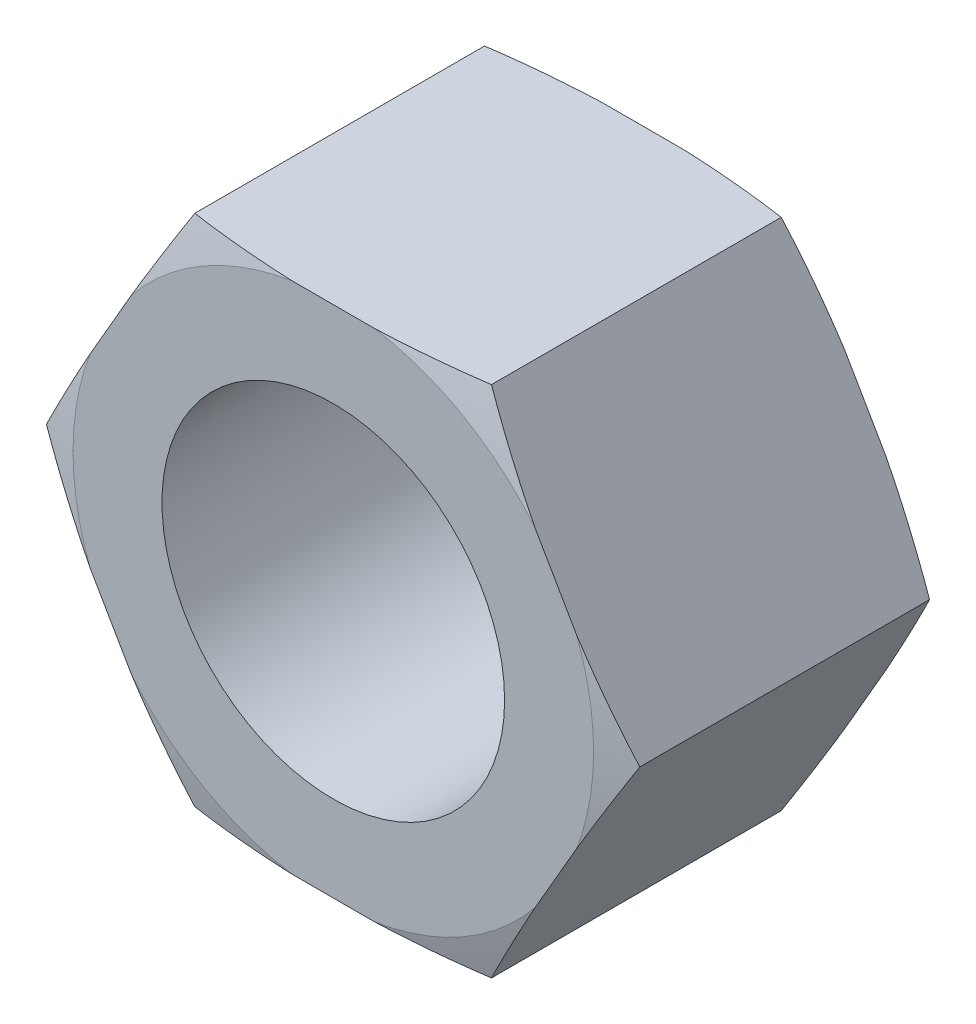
ISO-10303-21;
HEADER;
FILE_DESCRIPTION(('STEP AP214'),'2;1');
FILE_NAME('part.step','',(''),(''),'','','');
FILE_SCHEMA(('AUTOMOTIVE_DESIGN { 1 0 10303 214 1 1 1 1 }'));
ENDSEC;
DATA;
#1=APPLICATION_CONTEXT('core data for automotive mechanical design processes');
#2=APPLICATION_PROTOCOL_DEFINITION('international standard','automotive_design',2000,#1);
#3=PRODUCT_CONTEXT('',#1,'mechanical');
#4=PRODUCT('Part','Part','',(#3));
#5=PRODUCT_RELATED_PRODUCT_CATEGORY('part','',(#4));
#6=PRODUCT_DEFINITION_FORMATION('','',#4);
#7=PRODUCT_DEFINITION_CONTEXT('part definition',#1,'design');
#8=PRODUCT_DEFINITION('design','',#6,#7);
#9=PRODUCT_DEFINITION_SHAPE('','',#8);
#10=(LENGTH_UNIT() NAMED_UNIT(*) SI_UNIT(.MILLI.,.METRE.));
#11=(NAMED_UNIT(*) PLANE_ANGLE_UNIT() SI_UNIT($,.RADIAN.));
#12=(NAMED_UNIT(*) SI_UNIT($,.STERADIAN.) SOLID_ANGLE_UNIT());
#13=UNCERTAINTY_MEASURE_WITH_UNIT(LENGTH_MEASURE(1.E-05),#10,'distance_accuracy_value','');
#14=(GEOMETRIC_REPRESENTATION_CONTEXT(3) GLOBAL_UNCERTAINTY_ASSIGNED_CONTEXT((#13)) GLOBAL_UNIT_ASSIGNED_CONTEXT((#10,
#11,#12)) REPRESENTATION_CONTEXT('',''));
#15=CARTESIAN_POINT('',(0.,0.,0.));
#16=DIRECTION('',(0.,0.,1.));
#17=DIRECTION('',(1.,0.,0.));
#18=AXIS2_PLACEMENT_3D('',#15,#16,#17);
#19=CARTESIAN_POINT('',(6.92820323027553,12.,23.4500000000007));
#20=DIRECTION('',(0.866025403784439,0.5,0.));
#21=DIRECTION('',(-0.5,0.866025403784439,0.));
#22=AXIS2_PLACEMENT_3D('',#19,#20,#21);
#23=PLANE('',#22);
#24=DIRECTION('',(0.,0.,-1.));
#25=VECTOR('',#24,1.);
#26=CARTESIAN_POINT('',(13.856406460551,0.,23.4500000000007));
#27=LINE('',#26,#25);
#28=CARTESIAN_POINT('',(13.856406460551,0.,22.9916485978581));
#29=VERTEX_POINT('',#28);
#30=CARTESIAN_POINT('',(13.856406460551,0.,9.4583514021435));
#31=VERTEX_POINT('',#30);
#32=EDGE_CURVE('E190',#29,#31,#27,.T.);
#33=ORIENTED_EDGE('',*,*,#32,.T.);
#34=CARTESIAN_POINT('',(10.3923048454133,6.,57.5000000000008));
#35=DIRECTION('',(0.866025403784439,0.5,0.));
#36=DIRECTION('',(-0.5,0.866025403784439,0.));
#37=AXIS2_PLACEMENT_3D('',#34,#35,#36);
#38=CIRCLE('',#37,48.5386443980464);
#39=CARTESIAN_POINT('',(11.3605506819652,4.3229490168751,9.00000000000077));
#40=VERTEX_POINT('',#39);
#41=EDGE_CURVE('E233',#31,#40,#38,.T.);
#42=ORIENTED_EDGE('',*,*,#41,.T.);
#43=DIRECTION('',(0.5,-0.866025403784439,0.));
#44=VECTOR('',#43,1.);
#45=CARTESIAN_POINT('',(6.92820323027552,12.,9.00000000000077));
#46=LINE('',#45,#44);
#47=CARTESIAN_POINT('',(9.42405900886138,7.67705098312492,9.00000000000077));
#48=VERTEX_POINT('',#47);
#49=EDGE_CURVE('E209',#48,#40,#46,.T.);
#50=ORIENTED_EDGE('',*,*,#49,.F.);
#51=CARTESIAN_POINT('',(6.92820323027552,12.,9.4583514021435));
#52=VERTEX_POINT('',#51);
#53=EDGE_CURVE('E235',#48,#52,#38,.T.);
#54=ORIENTED_EDGE('',*,*,#53,.T.);
#55=DIRECTION('',(0.,0.,-1.));
#56=VECTOR('',#55,1.);
#57=CARTESIAN_POINT('',(6.92820323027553,12.,23.4500000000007));
#58=LINE('',#57,#56);
#59=CARTESIAN_POINT('',(6.92820323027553,12.,22.9916485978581));
#60=VERTEX_POINT('',#59);
#61=EDGE_CURVE('E150',#60,#52,#58,.T.);
#62=ORIENTED_EDGE('',*,*,#61,.F.);
#63=CARTESIAN_POINT('',(10.3923048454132,6.,-25.0499999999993));
#64=DIRECTION('',(0.866025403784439,0.5,0.));
#65=DIRECTION('',(-0.5,0.866025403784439,0.));
#66=AXIS2_PLACEMENT_3D('',#63,#64,#65);
#67=CIRCLE('',#66,48.5386443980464);
#68=CARTESIAN_POINT('',(9.42405900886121,7.67705098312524,23.4500000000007));
#69=VERTEX_POINT('',#68);
#70=EDGE_CURVE('E283',#60,#69,#67,.T.);
#71=ORIENTED_EDGE('',*,*,#70,.T.);
#72=DIRECTION('',(0.5,-0.866025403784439,0.));
#73=VECTOR('',#72,1.);
#74=CARTESIAN_POINT('',(6.92820323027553,12.,23.4500000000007));
#75=LINE('',#74,#73);
#76=CARTESIAN_POINT('',(11.3605506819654,4.32294901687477,23.4500000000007));
#77=VERTEX_POINT('',#76);
#78=EDGE_CURVE('E177',#69,#77,#75,.T.);
#79=ORIENTED_EDGE('',*,*,#78,.T.);
#80=EDGE_CURVE('E284',#77,#29,#67,.T.);
#81=ORIENTED_EDGE('',*,*,#80,.T.);
#82=EDGE_LOOP('',(#33,#42,#50,#54,#62,#71,#79,#81));
#83=FACE_BOUND('',#82,.T.);
#84=ADVANCED_FACE('F16',(#83),#23,.T.);
#85=CARTESIAN_POINT('',(-6.92820323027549,12.,23.4500000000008));
#86=DIRECTION('',(0.,1.,0.));
#87=DIRECTION('',(0.,0.,1.));
#88=AXIS2_PLACEMENT_3D('',#85,#86,#87);
#89=PLANE('',#88);
#90=ORIENTED_EDGE('',*,*,#61,.T.);
#91=CARTESIAN_POINT('',(0.,12.,57.5000000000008));
#92=DIRECTION('',(0.,1.,0.));
#93=DIRECTION('',(0.,0.,1.));
#94=AXIS2_PLACEMENT_3D('',#91,#92,#93);
#95=CIRCLE('',#94,48.5386443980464);
#96=CARTESIAN_POINT('',(1.93649167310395,12.,9.00000000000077));
#97=VERTEX_POINT('',#96);
#98=EDGE_CURVE('E234',#52,#97,#95,.T.);
#99=ORIENTED_EDGE('',*,*,#98,.T.);
#100=DIRECTION('',(1.,0.,0.));
#101=VECTOR('',#100,1.);
#102=CARTESIAN_POINT('',(-6.9282032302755,12.,9.00000000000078));
#103=LINE('',#102,#101);
#104=CARTESIAN_POINT('',(-1.93649167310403,12.,9.00000000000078));
#105=VERTEX_POINT('',#104);
#106=EDGE_CURVE('E169',#105,#97,#103,.T.);
#107=ORIENTED_EDGE('',*,*,#106,.F.);
#108=CARTESIAN_POINT('',(-6.9282032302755,12.,9.4583514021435));
#109=VERTEX_POINT('',#108);
#110=EDGE_CURVE('E239',#105,#109,#95,.T.);
#111=ORIENTED_EDGE('',*,*,#110,.T.);
#112=DIRECTION('',(0.,0.,-1.));
#113=VECTOR('',#112,1.);
#114=CARTESIAN_POINT('',(-6.92820323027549,12.,23.4500000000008));
#115=LINE('',#114,#113);
#116=CARTESIAN_POINT('',(-6.92820323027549,12.,22.9916485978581));
#117=VERTEX_POINT('',#116);
#118=EDGE_CURVE('E180',#117,#109,#115,.T.);
#119=ORIENTED_EDGE('',*,*,#118,.F.);
#120=CARTESIAN_POINT('',(0.,12.,-25.0499999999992));
#121=DIRECTION('',(0.,1.,0.));
#122=DIRECTION('',(0.,0.,1.));
#123=AXIS2_PLACEMENT_3D('',#120,#121,#122);
#124=CIRCLE('',#123,48.5386443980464);
#125=CARTESIAN_POINT('',(-1.93649167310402,12.,23.4500000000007));
#126=VERTEX_POINT('',#125);
#127=EDGE_CURVE('E278',#117,#126,#124,.T.);
#128=ORIENTED_EDGE('',*,*,#127,.T.);
#129=DIRECTION('',(1.,0.,0.));
#130=VECTOR('',#129,1.);
#131=CARTESIAN_POINT('',(-6.92820323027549,12.,23.4500000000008));
#132=LINE('',#131,#130);
#133=CARTESIAN_POINT('',(1.93649167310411,12.,23.4500000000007));
#134=VERTEX_POINT('',#133);
#135=EDGE_CURVE('E192',#126,#134,#132,.T.);
#136=ORIENTED_EDGE('',*,*,#135,.T.);
#137=EDGE_CURVE('E281',#134,#60,#124,.T.);
#138=ORIENTED_EDGE('',*,*,#137,.T.);
#139=EDGE_LOOP('',(#90,#99,#107,#111,#119,#128,#136,#138));
#140=FACE_BOUND('',#139,.T.);
#141=ADVANCED_FACE('F300',(#140),#89,.T.);
#142=CARTESIAN_POINT('',(-13.856406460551,0.,23.4500000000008));
#143=DIRECTION('',(-0.866025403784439,0.5,0.));
#144=DIRECTION('',(-0.5,-0.866025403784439,0.));
#145=AXIS2_PLACEMENT_3D('',#142,#143,#144);
#146=PLANE('',#145);
#147=ORIENTED_EDGE('',*,*,#118,.T.);
#148=CARTESIAN_POINT('',(-10.3923048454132,6.,57.5000000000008));
#149=DIRECTION('',(-0.866025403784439,0.5,0.));
#150=DIRECTION('',(-0.5,-0.866025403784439,0.));
#151=AXIS2_PLACEMENT_3D('',#148,#149,#150);
#152=CIRCLE('',#151,48.5386443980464);
#153=CARTESIAN_POINT('',(-9.42405900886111,7.67705098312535,9.00000000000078));
#154=VERTEX_POINT('',#153);
#155=EDGE_CURVE('E241',#109,#154,#152,.T.);
#156=ORIENTED_EDGE('',*,*,#155,.T.);
#157=DIRECTION('',(0.5,0.866025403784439,0.));
#158=VECTOR('',#157,1.);
#159=CARTESIAN_POINT('',(-13.856406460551,0.,9.00000000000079));
#160=LINE('',#159,#158);
#161=CARTESIAN_POINT('',(-11.3605506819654,4.32294901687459,9.00000000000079));
#162=VERTEX_POINT('',#161);
#163=EDGE_CURVE('E166',#162,#154,#160,.T.);
#164=ORIENTED_EDGE('',*,*,#163,.F.);
#165=CARTESIAN_POINT('',(-13.856406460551,0.,9.4583514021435));
#166=VERTEX_POINT('',#165);
#167=EDGE_CURVE('E144',#162,#166,#152,.T.);
#168=ORIENTED_EDGE('',*,*,#167,.T.);
#169=DIRECTION('',(0.,0.,-1.));
#170=VECTOR('',#169,1.);
#171=CARTESIAN_POINT('',(-13.856406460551,0.,23.4500000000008));
#172=LINE('',#171,#170);
#173=CARTESIAN_POINT('',(-13.856406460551,0.,22.9916485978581));
#174=VERTEX_POINT('',#173);
#175=EDGE_CURVE('E160',#174,#166,#172,.T.);
#176=ORIENTED_EDGE('',*,*,#175,.F.);
#177=CARTESIAN_POINT('',(-10.3923048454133,6.,-25.0499999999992));
#178=DIRECTION('',(-0.866025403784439,0.5,0.));
#179=DIRECTION('',(-0.5,-0.866025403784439,0.));
#180=AXIS2_PLACEMENT_3D('',#177,#178,#179);
#181=CIRCLE('',#180,48.5386443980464);
#182=CARTESIAN_POINT('',(-11.3605506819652,4.32294901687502,23.4500000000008));
#183=VERTEX_POINT('',#182);
#184=EDGE_CURVE('E290',#174,#183,#181,.T.);
#185=ORIENTED_EDGE('',*,*,#184,.T.);
#186=DIRECTION('',(0.5,0.866025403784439,0.));
#187=VECTOR('',#186,1.);
#188=CARTESIAN_POINT('',(-13.856406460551,0.,23.4500000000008));
#189=LINE('',#188,#187);
#190=CARTESIAN_POINT('',(-9.42405900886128,7.67705098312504,23.4500000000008));
#191=VERTEX_POINT('',#190);
#192=EDGE_CURVE('E198',#183,#191,#189,.T.);
#193=ORIENTED_EDGE('',*,*,#192,.T.);
#194=EDGE_CURVE('E292',#191,#117,#181,.T.);
#195=ORIENTED_EDGE('',*,*,#194,.T.);
#196=EDGE_LOOP('',(#147,#156,#164,#168,#176,#185,#193,#195));
#197=FACE_BOUND('',#196,.T.);
#198=ADVANCED_FACE('F294',(#197),#146,.T.);
#199=CARTESIAN_POINT('',(-6.92820323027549,-12.,23.4500000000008));
#200=DIRECTION('',(-0.866025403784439,-0.5,0.));
#201=DIRECTION('',(0.5,-0.866025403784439,0.));
#202=AXIS2_PLACEMENT_3D('',#199,#200,#201);
#203=PLANE('',#202);
#204=ORIENTED_EDGE('',*,*,#175,.T.);
#205=CARTESIAN_POINT('',(-10.3923048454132,-6.,57.5000000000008));
#206=DIRECTION('',(-0.866025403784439,-0.5,0.));
#207=DIRECTION('',(0.5,-0.866025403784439,0.));
#208=AXIS2_PLACEMENT_3D('',#205,#206,#207);
#209=CIRCLE('',#208,48.5386443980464);
#210=CARTESIAN_POINT('',(-11.3605506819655,-4.32294901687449,9.00000000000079));
#211=VERTEX_POINT('',#210);
#212=EDGE_CURVE('E142',#166,#211,#209,.T.);
#213=ORIENTED_EDGE('',*,*,#212,.T.);
#214=DIRECTION('',(-0.5,0.866025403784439,0.));
#215=VECTOR('',#214,1.);
#216=CARTESIAN_POINT('',(-6.92820323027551,-12.,9.00000000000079));
#217=LINE('',#216,#215);
#218=CARTESIAN_POINT('',(-9.42405900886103,-7.67705098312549,9.00000000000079));
#219=VERTEX_POINT('',#218);
#220=EDGE_CURVE('E157',#219,#211,#217,.T.);
#221=ORIENTED_EDGE('',*,*,#220,.F.);
#222=CARTESIAN_POINT('',(-6.9282032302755,-12.,9.4583514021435));
#223=VERTEX_POINT('',#222);
#224=EDGE_CURVE('E162',#219,#223,#209,.T.);
#225=ORIENTED_EDGE('',*,*,#224,.T.);
#226=DIRECTION('',(0.,0.,-1.));
#227=VECTOR('',#226,1.);
#228=CARTESIAN_POINT('',(-6.92820323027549,-12.,23.4500000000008));
#229=LINE('',#228,#227);
#230=CARTESIAN_POINT('',(-6.92820323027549,-12.,22.9916485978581));
#231=VERTEX_POINT('',#230);
#232=EDGE_CURVE('E184',#231,#223,#229,.T.);
#233=ORIENTED_EDGE('',*,*,#232,.F.);
#234=CARTESIAN_POINT('',(-10.3923048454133,-6.,-25.0499999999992));
#235=DIRECTION('',(-0.866025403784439,-0.5,0.));
#236=DIRECTION('',(0.5,-0.866025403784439,0.));
#237=AXIS2_PLACEMENT_3D('',#234,#235,#236);
#238=CIRCLE('',#237,48.5386443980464);
#239=CARTESIAN_POINT('',(-9.42405900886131,-7.67705098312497,23.4500000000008));
#240=VERTEX_POINT('',#239);
#241=EDGE_CURVE('E256',#231,#240,#238,.T.);
#242=ORIENTED_EDGE('',*,*,#241,.T.);
#243=DIRECTION('',(-0.5,0.866025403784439,0.));
#244=VECTOR('',#243,1.);
#245=CARTESIAN_POINT('',(-6.92820323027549,-12.,23.4500000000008));
#246=LINE('',#245,#244);
#247=CARTESIAN_POINT('',(-11.3605506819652,-4.32294901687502,23.4500000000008));
#248=VERTEX_POINT('',#247);
#249=EDGE_CURVE('E205',#240,#248,#246,.T.);
#250=ORIENTED_EDGE('',*,*,#249,.T.);
#251=EDGE_CURVE('E247',#248,#174,#238,.T.);
#252=ORIENTED_EDGE('',*,*,#251,.T.);
#253=EDGE_LOOP('',(#204,#213,#221,#225,#233,#242,#250,#252));
#254=FACE_BOUND('',#253,.T.);
#255=ADVANCED_FACE('F155',(#254),#203,.T.);
#256=CARTESIAN_POINT('',(6.92820323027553,-12.,23.4500000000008));
#257=DIRECTION('',(0.,-1.,0.));
#258=DIRECTION('',(1.,0.,0.));
#259=AXIS2_PLACEMENT_3D('',#256,#257,#258);
#260=PLANE('',#259);
#261=ORIENTED_EDGE('',*,*,#232,.T.);
#262=CARTESIAN_POINT('',(0.,-12.,57.5000000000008));
#263=DIRECTION('',(0.,-1.,0.));
#264=DIRECTION('',(1.,0.,0.));
#265=AXIS2_PLACEMENT_3D('',#262,#263,#264);
#266=CIRCLE('',#265,48.5386443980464);
#267=CARTESIAN_POINT('',(-1.93649167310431,-12.,9.00000000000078));
#268=VERTEX_POINT('',#267);
#269=EDGE_CURVE('E231',#223,#268,#266,.T.);
#270=ORIENTED_EDGE('',*,*,#269,.T.);
#271=DIRECTION('',(-1.,0.,0.));
#272=VECTOR('',#271,1.);
#273=CARTESIAN_POINT('',(6.92820323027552,-12.,9.00000000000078));
#274=LINE('',#273,#272);
#275=CARTESIAN_POINT('',(1.93649167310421,-12.,9.00000000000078));
#276=VERTEX_POINT('',#275);
#277=EDGE_CURVE('E167',#276,#268,#274,.T.);
#278=ORIENTED_EDGE('',*,*,#277,.F.);
#279=CARTESIAN_POINT('',(6.92820323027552,-12.,9.4583514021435));
#280=VERTEX_POINT('',#279);
#281=EDGE_CURVE('E228',#276,#280,#266,.T.);
#282=ORIENTED_EDGE('',*,*,#281,.T.);
#283=DIRECTION('',(0.,0.,-1.));
#284=VECTOR('',#283,1.);
#285=CARTESIAN_POINT('',(6.92820323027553,-12.,23.4500000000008));
#286=LINE('',#285,#284);
#287=CARTESIAN_POINT('',(6.92820323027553,-12.,22.9916485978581));
#288=VERTEX_POINT('',#287);
#289=EDGE_CURVE('E187',#288,#280,#286,.T.);
#290=ORIENTED_EDGE('',*,*,#289,.F.);
#291=CARTESIAN_POINT('',(0.,-12.,-25.0499999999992));
#292=DIRECTION('',(0.,-1.,0.));
#293=DIRECTION('',(1.,0.,0.));
#294=AXIS2_PLACEMENT_3D('',#291,#292,#293);
#295=CIRCLE('',#294,48.5386443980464);
#296=CARTESIAN_POINT('',(1.93649167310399,-12.,23.4500000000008));
#297=VERTEX_POINT('',#296);
#298=EDGE_CURVE('E288',#288,#297,#295,.T.);
#299=ORIENTED_EDGE('',*,*,#298,.T.);
#300=DIRECTION('',(-1.,0.,0.));
#301=VECTOR('',#300,1.);
#302=CARTESIAN_POINT('',(6.92820323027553,-12.,23.4500000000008));
#303=LINE('',#302,#301);
#304=CARTESIAN_POINT('',(-1.93649167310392,-12.,23.4500000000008));
#305=VERTEX_POINT('',#304);
#306=EDGE_CURVE('E267',#297,#305,#303,.T.);
#307=ORIENTED_EDGE('',*,*,#306,.T.);
#308=EDGE_CURVE('E39',#305,#231,#295,.T.);
#309=ORIENTED_EDGE('',*,*,#308,.T.);
#310=EDGE_LOOP('',(#261,#270,#278,#282,#290,#299,#307,#309));
#311=FACE_BOUND('',#310,.T.);
#312=ADVANCED_FACE('F250',(#311),#260,.T.);
#313=CARTESIAN_POINT('',(13.856406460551,0.,23.4500000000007));
#314=DIRECTION('',(0.866025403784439,-0.5,0.));
#315=DIRECTION('',(0.5,0.866025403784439,0.));
#316=AXIS2_PLACEMENT_3D('',#313,#314,#315);
#317=PLANE('',#316);
#318=ORIENTED_EDGE('',*,*,#289,.T.);
#319=CARTESIAN_POINT('',(10.3923048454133,-6.,57.5000000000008));
#320=DIRECTION('',(0.866025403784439,-0.5,0.));
#321=DIRECTION('',(0.5,0.866025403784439,0.));
#322=AXIS2_PLACEMENT_3D('',#319,#320,#321);
#323=CIRCLE('',#322,48.5386443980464);
#324=CARTESIAN_POINT('',(9.42405900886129,-7.67705098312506,9.00000000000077));
#325=VERTEX_POINT('',#324);
#326=EDGE_CURVE('E224',#280,#325,#323,.T.);
#327=ORIENTED_EDGE('',*,*,#326,.T.);
#328=DIRECTION('',(-0.5,-0.866025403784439,0.));
#329=VECTOR('',#328,1.);
#330=CARTESIAN_POINT('',(13.856406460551,0.,9.00000000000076));
#331=LINE('',#330,#329);
#332=CARTESIAN_POINT('',(11.3605506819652,-4.322949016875,9.00000000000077));
#333=VERTEX_POINT('',#332);
#334=EDGE_CURVE('E171',#333,#325,#331,.T.);
#335=ORIENTED_EDGE('',*,*,#334,.F.);
#336=EDGE_CURVE('E223',#333,#31,#323,.T.);
#337=ORIENTED_EDGE('',*,*,#336,.T.);
#338=ORIENTED_EDGE('',*,*,#32,.F.);
#339=CARTESIAN_POINT('',(10.3923048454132,-6.,-25.0499999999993));
#340=DIRECTION('',(0.866025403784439,-0.5,0.));
#341=DIRECTION('',(0.5,0.866025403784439,0.));
#342=AXIS2_PLACEMENT_3D('',#339,#340,#341);
#343=CIRCLE('',#342,48.5386443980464);
#344=CARTESIAN_POINT('',(11.3605506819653,-4.32294901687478,23.4500000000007));
#345=VERTEX_POINT('',#344);
#346=EDGE_CURVE('E286',#29,#345,#343,.T.);
#347=ORIENTED_EDGE('',*,*,#346,.T.);
#348=DIRECTION('',(-0.5,-0.866025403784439,0.));
#349=VECTOR('',#348,1.);
#350=CARTESIAN_POINT('',(13.856406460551,0.,23.4500000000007));
#351=LINE('',#350,#349);
#352=CARTESIAN_POINT('',(9.42405900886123,-7.67705098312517,23.4500000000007));
#353=VERTEX_POINT('',#352);
#354=EDGE_CURVE('E268',#345,#353,#351,.T.);
#355=ORIENTED_EDGE('',*,*,#354,.T.);
#356=EDGE_CURVE('E31',#353,#288,#343,.T.);
#357=ORIENTED_EDGE('',*,*,#356,.T.);
#358=EDGE_LOOP('',(#318,#327,#335,#337,#338,#347,#355,#357));
#359=FACE_BOUND('',#358,.T.);
#360=ADVANCED_FACE('F222',(#359),#317,.T.);
#361=CARTESIAN_POINT('',(0.,0.,23.4500000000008));
#362=DIRECTION('',(0.,0.,-1.));
#363=DIRECTION('',(-1.,0.,0.));
#364=AXIS2_PLACEMENT_3D('',#361,#362,#363);
#365=PLANE('',#364);
#366=CARTESIAN_POINT('',(0.,0.,23.4500000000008));
#367=DIRECTION('',(0.,0.,-1.));
#368=DIRECTION('',(1.,0.,0.));
#369=AXIS2_PLACEMENT_3D('',#366,#367,#368);
#370=CIRCLE('',#369,8.);
#371=CARTESIAN_POINT('',(8.00000000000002,0.,23.4500000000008));
#372=VERTEX_POINT('',#371);
#373=EDGE_CURVE('E211',#372,#372,#370,.T.);
#374=ORIENTED_EDGE('',*,*,#373,.T.);
#375=EDGE_LOOP('',(#374));
#376=FACE_BOUND('',#375,.T.);
#377=CARTESIAN_POINT('',(0.,0.,23.4500000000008));
#378=DIRECTION('',(0.,0.,-1.));
#379=DIRECTION('',(-1.,0.,0.));
#380=AXIS2_PLACEMENT_3D('',#377,#378,#379);
#381=CIRCLE('',#380,12.1552457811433);
#382=EDGE_CURVE('E11',#191,#126,#381,.T.);
#383=ORIENTED_EDGE('',*,*,#382,.F.);
#384=ORIENTED_EDGE('',*,*,#192,.F.);
#385=EDGE_CURVE('E19',#248,#183,#381,.T.);
#386=ORIENTED_EDGE('',*,*,#385,.F.);
#387=ORIENTED_EDGE('',*,*,#249,.F.);
#388=EDGE_CURVE('E264',#305,#240,#381,.T.);
#389=ORIENTED_EDGE('',*,*,#388,.F.);
#390=ORIENTED_EDGE('',*,*,#306,.F.);
#391=EDGE_CURVE('E309',#353,#297,#381,.T.);
#392=ORIENTED_EDGE('',*,*,#391,.F.);
#393=ORIENTED_EDGE('',*,*,#354,.F.);
#394=EDGE_CURVE('E306',#77,#345,#381,.T.);
#395=ORIENTED_EDGE('',*,*,#394,.F.);
#396=ORIENTED_EDGE('',*,*,#78,.F.);
#397=EDGE_CURVE('E24',#134,#69,#381,.T.);
#398=ORIENTED_EDGE('',*,*,#397,.F.);
#399=ORIENTED_EDGE('',*,*,#135,.F.);
#400=EDGE_LOOP('',(#383,#384,#386,#387,#389,#390,#392,#393,#395,#396,#398,#399));
#401=FACE_BOUND('',#400,.T.);
#402=ADVANCED_FACE('F262',(#376,#401),#365,.F.);
#403=CARTESIAN_POINT('',(0.,0.,9.00000000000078));
#404=DIRECTION('',(0.,0.,-1.));
#405=DIRECTION('',(-1.,0.,0.));
#406=AXIS2_PLACEMENT_3D('',#403,#404,#405);
#407=PLANE('',#406);
#408=CARTESIAN_POINT('',(0.,0.,9.00000000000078));
#409=DIRECTION('',(0.,0.,-1.));
#410=DIRECTION('',(1.,0.,0.));
#411=AXIS2_PLACEMENT_3D('',#408,#409,#410);
#412=CIRCLE('',#411,8.);
#413=CARTESIAN_POINT('',(8.00000000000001,0.,9.00000000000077));
#414=VERTEX_POINT('',#413);
#415=EDGE_CURVE('E275',#414,#414,#412,.T.);
#416=ORIENTED_EDGE('',*,*,#415,.F.);
#417=EDGE_LOOP('',(#416));
#418=FACE_BOUND('',#417,.T.);
#419=ORIENTED_EDGE('',*,*,#163,.T.);
#420=CARTESIAN_POINT('',(0.,0.,9.00000000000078));
#421=DIRECTION('',(0.,0.,-1.));
#422=DIRECTION('',(-1.,0.,0.));
#423=AXIS2_PLACEMENT_3D('',#420,#421,#422);
#424=CIRCLE('',#423,12.1552457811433);
#425=EDGE_CURVE('E151',#154,#105,#424,.T.);
#426=ORIENTED_EDGE('',*,*,#425,.T.);
#427=ORIENTED_EDGE('',*,*,#106,.T.);
#428=EDGE_CURVE('E312',#97,#48,#424,.T.);
#429=ORIENTED_EDGE('',*,*,#428,.T.);
#430=ORIENTED_EDGE('',*,*,#49,.T.);
#431=EDGE_CURVE('E218',#40,#333,#424,.T.);
#432=ORIENTED_EDGE('',*,*,#431,.T.);
#433=ORIENTED_EDGE('',*,*,#334,.T.);
#434=EDGE_CURVE('E216',#325,#276,#424,.T.);
#435=ORIENTED_EDGE('',*,*,#434,.T.);
#436=ORIENTED_EDGE('',*,*,#277,.T.);
#437=EDGE_CURVE('E149',#268,#219,#424,.T.);
#438=ORIENTED_EDGE('',*,*,#437,.T.);
#439=ORIENTED_EDGE('',*,*,#220,.T.);
#440=EDGE_CURVE('E139',#211,#162,#424,.T.);
#441=ORIENTED_EDGE('',*,*,#440,.T.);
#442=EDGE_LOOP('',(#419,#426,#427,#429,#430,#432,#433,#435,#436,#438,#439,#441));
#443=FACE_BOUND('',#442,.T.);
#444=ADVANCED_FACE('F164',(#418,#443),#407,.T.);
#445=CARTESIAN_POINT('',(0.,0.,23.4500000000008));
#446=DIRECTION('',(0.,0.,-1.));
#447=DIRECTION('',(-1.,0.,0.));
#448=AXIS2_PLACEMENT_3D('',#445,#446,#447);
#449=CYLINDRICAL_SURFACE('',#448,8.);
#450=ORIENTED_EDGE('',*,*,#373,.F.);
#451=EDGE_LOOP('',(#450));
#452=FACE_BOUND('',#451,.T.);
#453=ORIENTED_EDGE('',*,*,#415,.T.);
#454=EDGE_LOOP('',(#453));
#455=FACE_BOUND('',#454,.T.);
#456=ADVANCED_FACE('F357',(#452,#455),#449,.F.);
#457=CARTESIAN_POINT('',(0.,0.,57.5000000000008));
#458=DIRECTION('',(0.,0.,1.));
#459=DIRECTION('',(0.,1.,0.));
#460=AXIS2_PLACEMENT_3D('',#457,#458,#459);
#461=SPHERICAL_SURFACE('',#460,50.);
#462=ORIENTED_EDGE('',*,*,#440,.F.);
#463=ORIENTED_EDGE('',*,*,#212,.F.);
#464=ORIENTED_EDGE('',*,*,#167,.F.);
#465=EDGE_LOOP('',(#462,#463,#464));
#466=FACE_BOUND('',#465,.T.);
#467=ADVANCED_FACE('F141',(#466),#461,.T.);
#468=ORIENTED_EDGE('',*,*,#437,.F.);
#469=ORIENTED_EDGE('',*,*,#269,.F.);
#470=ORIENTED_EDGE('',*,*,#224,.F.);
#471=EDGE_LOOP('',(#468,#469,#470));
#472=FACE_BOUND('',#471,.T.);
#473=ADVANCED_FACE('F253',(#472),#461,.T.);
#474=ORIENTED_EDGE('',*,*,#434,.F.);
#475=ORIENTED_EDGE('',*,*,#326,.F.);
#476=ORIENTED_EDGE('',*,*,#281,.F.);
#477=EDGE_LOOP('',(#474,#475,#476));
#478=FACE_BOUND('',#477,.T.);
#479=ADVANCED_FACE('F368',(#478),#461,.T.);
#480=ORIENTED_EDGE('',*,*,#336,.F.);
#481=ORIENTED_EDGE('',*,*,#431,.F.);
#482=ORIENTED_EDGE('',*,*,#41,.F.);
#483=EDGE_LOOP('',(#480,#481,#482));
#484=FACE_BOUND('',#483,.T.);
#485=ADVANCED_FACE('F377',(#484),#461,.T.);
#486=ORIENTED_EDGE('',*,*,#428,.F.);
#487=ORIENTED_EDGE('',*,*,#98,.F.);
#488=ORIENTED_EDGE('',*,*,#53,.F.);
#489=EDGE_LOOP('',(#486,#487,#488));
#490=FACE_BOUND('',#489,.T.);
#491=ADVANCED_FACE('F316',(#490),#461,.T.);
#492=ORIENTED_EDGE('',*,*,#425,.F.);
#493=ORIENTED_EDGE('',*,*,#155,.F.);
#494=ORIENTED_EDGE('',*,*,#110,.F.);
#495=EDGE_LOOP('',(#492,#493,#494));
#496=FACE_BOUND('',#495,.T.);
#497=ADVANCED_FACE('F363',(#496),#461,.T.);
#498=CARTESIAN_POINT('',(0.,0.,-25.0499999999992));
#499=DIRECTION('',(0.,0.,1.));
#500=DIRECTION('',(0.,-1.,0.));
#501=AXIS2_PLACEMENT_3D('',#498,#499,#500);
#502=SPHERICAL_SURFACE('',#501,50.);
#503=ORIENTED_EDGE('',*,*,#251,.F.);
#504=ORIENTED_EDGE('',*,*,#385,.T.);
#505=ORIENTED_EDGE('',*,*,#184,.F.);
#506=EDGE_LOOP('',(#503,#504,#505));
#507=FACE_BOUND('',#506,.T.);
#508=ADVANCED_FACE('F327',(#507),#502,.T.);
#509=ORIENTED_EDGE('',*,*,#308,.F.);
#510=ORIENTED_EDGE('',*,*,#388,.T.);
#511=ORIENTED_EDGE('',*,*,#241,.F.);
#512=EDGE_LOOP('',(#509,#510,#511));
#513=FACE_BOUND('',#512,.T.);
#514=ADVANCED_FACE('F376',(#513),#502,.T.);
#515=ORIENTED_EDGE('',*,*,#356,.F.);
#516=ORIENTED_EDGE('',*,*,#391,.T.);
#517=ORIENTED_EDGE('',*,*,#298,.F.);
#518=EDGE_LOOP('',(#515,#516,#517));
#519=FACE_BOUND('',#518,.T.);
#520=ADVANCED_FACE('F328',(#519),#502,.T.);
#521=ORIENTED_EDGE('',*,*,#394,.T.);
#522=ORIENTED_EDGE('',*,*,#346,.F.);
#523=ORIENTED_EDGE('',*,*,#80,.F.);
#524=EDGE_LOOP('',(#521,#522,#523));
#525=FACE_BOUND('',#524,.T.);
#526=ADVANCED_FACE('F319',(#525),#502,.T.);
#527=ORIENTED_EDGE('',*,*,#137,.F.);
#528=ORIENTED_EDGE('',*,*,#397,.T.);
#529=ORIENTED_EDGE('',*,*,#70,.F.);
#530=EDGE_LOOP('',(#527,#528,#529));
#531=FACE_BOUND('',#530,.T.);
#532=ADVANCED_FACE('F317',(#531),#502,.T.);
#533=ORIENTED_EDGE('',*,*,#194,.F.);
#534=ORIENTED_EDGE('',*,*,#382,.T.);
#535=ORIENTED_EDGE('',*,*,#127,.F.);
#536=EDGE_LOOP('',(#533,#534,#535));
#537=FACE_BOUND('',#536,.T.);
#538=ADVANCED_FACE('F298',(#537),#502,.T.);
#539=CLOSED_SHELL('',(#84,#141,#198,#255,#312,#360,#402,#444,#456,#467,#473,#479,#485,#491,#497,
#508,#514,#520,#526,#532,#538));
#540=MANIFOLD_SOLID_BREP('B1',#539);
#541=ADVANCED_BREP_SHAPE_REPRESENTATION('',(#18,#540),#14);
#542=SHAPE_DEFINITION_REPRESENTATION(#9,#541);
ENDSEC;
END-ISO-10303-21;
